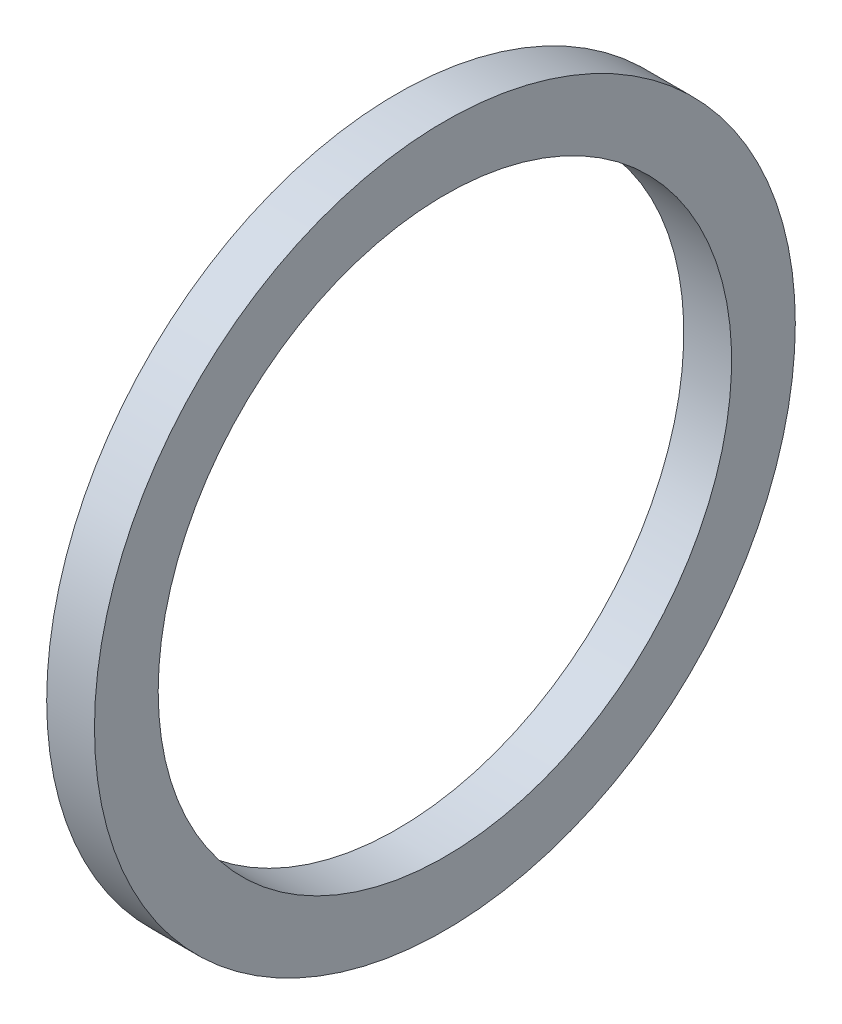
ISO-10303-21;
HEADER;
FILE_DESCRIPTION(('STEP AP214'),'2;1');
FILE_NAME('part.step','',(''),(''),'','','');
FILE_SCHEMA(('AUTOMOTIVE_DESIGN { 1 0 10303 214 1 1 1 1 }'));
ENDSEC;
DATA;
#1=APPLICATION_CONTEXT('core data for automotive mechanical design processes');
#2=APPLICATION_PROTOCOL_DEFINITION('international standard','automotive_design',2000,#1);
#3=PRODUCT_CONTEXT('',#1,'mechanical');
#4=PRODUCT('Part','Part','',(#3));
#5=PRODUCT_RELATED_PRODUCT_CATEGORY('part','',(#4));
#6=PRODUCT_DEFINITION_FORMATION('','',#4);
#7=PRODUCT_DEFINITION_CONTEXT('part definition',#1,'design');
#8=PRODUCT_DEFINITION('design','',#6,#7);
#9=PRODUCT_DEFINITION_SHAPE('','',#8);
#10=(LENGTH_UNIT() NAMED_UNIT(*) SI_UNIT(.MILLI.,.METRE.));
#11=(NAMED_UNIT(*) PLANE_ANGLE_UNIT() SI_UNIT($,.RADIAN.));
#12=(NAMED_UNIT(*) SI_UNIT($,.STERADIAN.) SOLID_ANGLE_UNIT());
#13=UNCERTAINTY_MEASURE_WITH_UNIT(LENGTH_MEASURE(1.E-05),#10,'distance_accuracy_value','');
#14=(GEOMETRIC_REPRESENTATION_CONTEXT(3) GLOBAL_UNCERTAINTY_ASSIGNED_CONTEXT((#13)) GLOBAL_UNIT_ASSIGNED_CONTEXT((#10,
#11,#12)) REPRESENTATION_CONTEXT('',''));
#15=CARTESIAN_POINT('',(0.,0.,0.));
#16=DIRECTION('',(0.,0.,1.));
#17=DIRECTION('',(1.,0.,0.));
#18=AXIS2_PLACEMENT_3D('',#15,#16,#17);
#19=CARTESIAN_POINT('',(0.,0.,-22.));
#20=DIRECTION('',(1.,0.,0.));
#21=DIRECTION('',(0.,0.,-1.));
#22=AXIS2_PLACEMENT_3D('',#19,#20,#21);
#23=PLANE('',#22);
#24=CARTESIAN_POINT('',(0.,0.,0.));
#25=DIRECTION('',(-1.,0.,0.));
#26=DIRECTION('',(0.,0.,1.));
#27=AXIS2_PLACEMENT_3D('',#24,#25,#26);
#28=CIRCLE('',#27,18.);
#29=CARTESIAN_POINT('',(0.,0.,18.));
#30=VERTEX_POINT('',#29);
#31=EDGE_CURVE('E10',#30,#30,#28,.T.);
#32=ORIENTED_EDGE('',*,*,#31,.F.);
#33=EDGE_LOOP('',(#32));
#34=FACE_BOUND('',#33,.T.);
#35=CARTESIAN_POINT('',(0.,0.,0.));
#36=DIRECTION('',(-1.,0.,0.));
#37=DIRECTION('',(0.,0.,1.));
#38=AXIS2_PLACEMENT_3D('',#35,#36,#37);
#39=CIRCLE('',#38,22.);
#40=CARTESIAN_POINT('',(0.,0.,22.));
#41=VERTEX_POINT('',#40);
#42=EDGE_CURVE('E43',#41,#41,#39,.T.);
#43=ORIENTED_EDGE('',*,*,#42,.T.);
#44=EDGE_LOOP('',(#43));
#45=FACE_BOUND('',#44,.T.);
#46=ADVANCED_FACE('F29',(#34,#45),#23,.F.);
#47=CARTESIAN_POINT('',(0.,0.,0.));
#48=DIRECTION('',(-1.,0.,0.));
#49=DIRECTION('',(0.,0.,1.));
#50=AXIS2_PLACEMENT_3D('',#47,#48,#49);
#51=CYLINDRICAL_SURFACE('',#50,18.);
#52=CARTESIAN_POINT('',(3.,0.,0.));
#53=DIRECTION('',(-1.,0.,0.));
#54=DIRECTION('',(0.,0.,1.));
#55=AXIS2_PLACEMENT_3D('',#52,#53,#54);
#56=CIRCLE('',#55,18.);
#57=CARTESIAN_POINT('',(3.,0.,18.));
#58=VERTEX_POINT('',#57);
#59=EDGE_CURVE('E35',#58,#58,#56,.T.);
#60=ORIENTED_EDGE('',*,*,#59,.F.);
#61=EDGE_LOOP('',(#60));
#62=FACE_BOUND('',#61,.T.);
#63=ORIENTED_EDGE('',*,*,#31,.T.);
#64=EDGE_LOOP('',(#63));
#65=FACE_BOUND('',#64,.T.);
#66=ADVANCED_FACE('F58',(#62,#65),#51,.F.);
#67=CARTESIAN_POINT('',(3.,0.,-22.));
#68=DIRECTION('',(-1.,0.,0.));
#69=DIRECTION('',(0.,0.,1.));
#70=AXIS2_PLACEMENT_3D('',#67,#68,#69);
#71=PLANE('',#70);
#72=CARTESIAN_POINT('',(3.,0.,0.));
#73=DIRECTION('',(-1.,0.,0.));
#74=DIRECTION('',(0.,0.,1.));
#75=AXIS2_PLACEMENT_3D('',#72,#73,#74);
#76=CIRCLE('',#75,22.);
#77=CARTESIAN_POINT('',(3.,0.,22.));
#78=VERTEX_POINT('',#77);
#79=EDGE_CURVE('E39',#78,#78,#76,.T.);
#80=ORIENTED_EDGE('',*,*,#79,.F.);
#81=EDGE_LOOP('',(#80));
#82=FACE_BOUND('',#81,.T.);
#83=ORIENTED_EDGE('',*,*,#59,.T.);
#84=EDGE_LOOP('',(#83));
#85=FACE_BOUND('',#84,.T.);
#86=ADVANCED_FACE('F53',(#82,#85),#71,.F.);
#87=CARTESIAN_POINT('',(0.,0.,0.));
#88=DIRECTION('',(-1.,0.,0.));
#89=DIRECTION('',(0.,0.,1.));
#90=AXIS2_PLACEMENT_3D('',#87,#88,#89);
#91=CYLINDRICAL_SURFACE('',#90,22.);
#92=ORIENTED_EDGE('',*,*,#42,.F.);
#93=EDGE_LOOP('',(#92));
#94=FACE_BOUND('',#93,.T.);
#95=ORIENTED_EDGE('',*,*,#79,.T.);
#96=EDGE_LOOP('',(#95));
#97=FACE_BOUND('',#96,.T.);
#98=ADVANCED_FACE('F50',(#94,#97),#91,.T.);
#99=CLOSED_SHELL('',(#46,#66,#86,#98));
#100=MANIFOLD_SOLID_BREP('B2',#99);
#101=ADVANCED_BREP_SHAPE_REPRESENTATION('',(#18,#100),#14);
#102=SHAPE_DEFINITION_REPRESENTATION(#9,#101);
ENDSEC;
END-ISO-10303-21;
